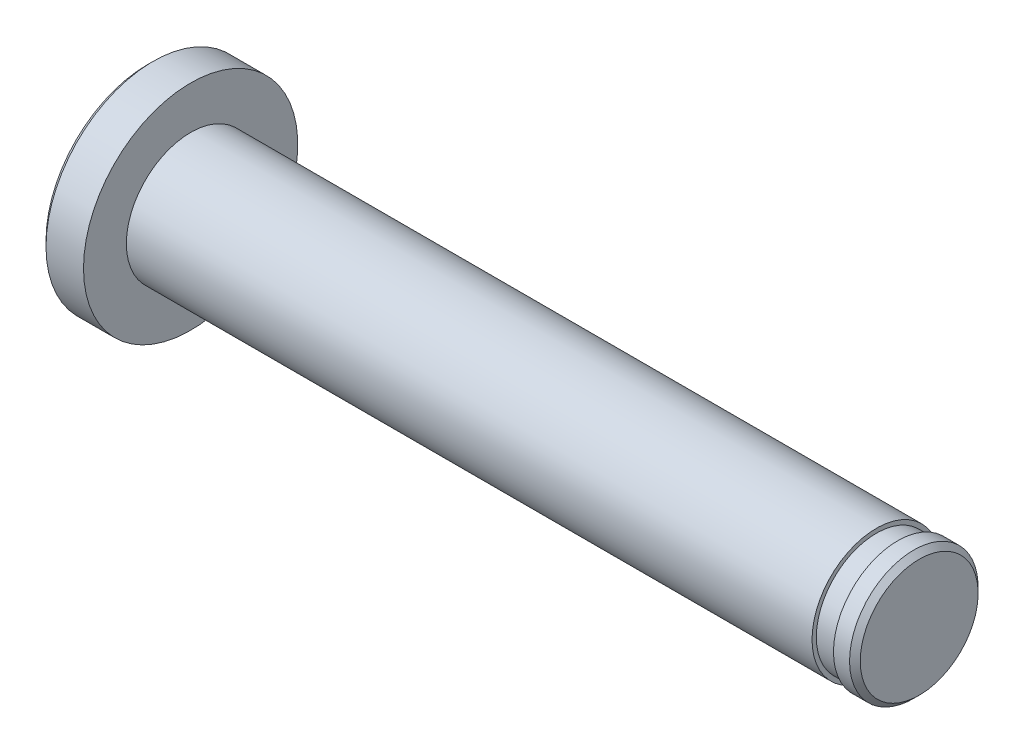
ISO-10303-21;
HEADER;
FILE_DESCRIPTION(('STEP AP214'),'2;1');
FILE_NAME('part.step','',(''),(''),'','','');
FILE_SCHEMA(('AUTOMOTIVE_DESIGN { 1 0 10303 214 1 1 1 1 }'));
ENDSEC;
DATA;
#1=APPLICATION_CONTEXT('core data for automotive mechanical design processes');
#2=APPLICATION_PROTOCOL_DEFINITION('international standard','automotive_design',2000,#1);
#3=PRODUCT_CONTEXT('',#1,'mechanical');
#4=PRODUCT('Part','Part','',(#3));
#5=PRODUCT_RELATED_PRODUCT_CATEGORY('part','',(#4));
#6=PRODUCT_DEFINITION_FORMATION('','',#4);
#7=PRODUCT_DEFINITION_CONTEXT('part definition',#1,'design');
#8=PRODUCT_DEFINITION('design','',#6,#7);
#9=PRODUCT_DEFINITION_SHAPE('','',#8);
#10=(LENGTH_UNIT() NAMED_UNIT(*) SI_UNIT(.MILLI.,.METRE.));
#11=(NAMED_UNIT(*) PLANE_ANGLE_UNIT() SI_UNIT($,.RADIAN.));
#12=(NAMED_UNIT(*) SI_UNIT($,.STERADIAN.) SOLID_ANGLE_UNIT());
#13=UNCERTAINTY_MEASURE_WITH_UNIT(LENGTH_MEASURE(1.E-05),#10,'distance_accuracy_value','');
#14=(GEOMETRIC_REPRESENTATION_CONTEXT(3) GLOBAL_UNCERTAINTY_ASSIGNED_CONTEXT((#13)) GLOBAL_UNIT_ASSIGNED_CONTEXT((#10,
#11,#12)) REPRESENTATION_CONTEXT('',''));
#15=CARTESIAN_POINT('',(0.,0.,0.));
#16=DIRECTION('',(0.,0.,1.));
#17=DIRECTION('',(1.,0.,0.));
#18=AXIS2_PLACEMENT_3D('',#15,#16,#17);
#19=CARTESIAN_POINT('',(34.,2.75,0.));
#20=DIRECTION('',(-1.,0.,0.));
#21=DIRECTION('',(0.,0.,1.));
#22=AXIS2_PLACEMENT_3D('',#19,#20,#21);
#23=PLANE('',#22);
#24=CARTESIAN_POINT('',(34.,0.,0.));
#25=DIRECTION('',(-1.,0.,0.));
#26=DIRECTION('',(0.,0.,1.));
#27=AXIS2_PLACEMENT_3D('',#24,#25,#26);
#28=CIRCLE('',#27,2.75);
#29=CARTESIAN_POINT('',(34.,0.,2.75));
#30=VERTEX_POINT('',#29);
#31=EDGE_CURVE('E10',#30,#30,#28,.T.);
#32=ORIENTED_EDGE('',*,*,#31,.F.);
#33=EDGE_LOOP('',(#32));
#34=FACE_BOUND('',#33,.T.);
#35=ADVANCED_FACE('F31',(#34),#23,.F.);
#36=CARTESIAN_POINT('',(34.,0.,0.));
#37=DIRECTION('',(-1.,0.,0.));
#38=DIRECTION('',(0.,0.,1.));
#39=AXIS2_PLACEMENT_3D('',#36,#37,#38);
#40=CONICAL_SURFACE('',#39,2.75,0.785398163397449);
#41=CARTESIAN_POINT('',(33.75,0.,0.));
#42=DIRECTION('',(-1.,0.,0.));
#43=DIRECTION('',(0.,0.,1.));
#44=AXIS2_PLACEMENT_3D('',#41,#42,#43);
#45=CIRCLE('',#44,3.);
#46=CARTESIAN_POINT('',(33.75,0.,3.));
#47=VERTEX_POINT('',#46);
#48=EDGE_CURVE('E37',#47,#47,#45,.T.);
#49=ORIENTED_EDGE('',*,*,#48,.F.);
#50=EDGE_LOOP('',(#49));
#51=FACE_BOUND('',#50,.T.);
#52=ORIENTED_EDGE('',*,*,#31,.T.);
#53=EDGE_LOOP('',(#52));
#54=FACE_BOUND('',#53,.T.);
#55=ADVANCED_FACE('F115',(#51,#54),#40,.T.);
#56=CARTESIAN_POINT('',(0.,0.,0.));
#57=DIRECTION('',(-1.,0.,0.));
#58=DIRECTION('',(0.,0.,1.));
#59=AXIS2_PLACEMENT_3D('',#56,#57,#58);
#60=CYLINDRICAL_SURFACE('',#59,3.);
#61=CARTESIAN_POINT('',(33.,0.,0.));
#62=DIRECTION('',(-1.,0.,0.));
#63=DIRECTION('',(0.,0.,1.));
#64=AXIS2_PLACEMENT_3D('',#61,#62,#63);
#65=CIRCLE('',#64,3.);
#66=CARTESIAN_POINT('',(33.,0.,3.));
#67=VERTEX_POINT('',#66);
#68=EDGE_CURVE('E41',#67,#67,#65,.T.);
#69=ORIENTED_EDGE('',*,*,#68,.F.);
#70=EDGE_LOOP('',(#69));
#71=FACE_BOUND('',#70,.T.);
#72=ORIENTED_EDGE('',*,*,#48,.T.);
#73=EDGE_LOOP('',(#72));
#74=FACE_BOUND('',#73,.T.);
#75=ADVANCED_FACE('F110',(#71,#74),#60,.T.);
#76=CARTESIAN_POINT('',(33.,2.8,0.));
#77=DIRECTION('',(1.,0.,0.));
#78=DIRECTION('',(0.,0.,-1.));
#79=AXIS2_PLACEMENT_3D('',#76,#77,#78);
#80=PLANE('',#79);
#81=CARTESIAN_POINT('',(33.,0.,0.));
#82=DIRECTION('',(-1.,0.,0.));
#83=DIRECTION('',(0.,0.,1.));
#84=AXIS2_PLACEMENT_3D('',#81,#82,#83);
#85=CIRCLE('',#84,2.8);
#86=CARTESIAN_POINT('',(33.,0.,2.8));
#87=VERTEX_POINT('',#86);
#88=EDGE_CURVE('E45',#87,#87,#85,.T.);
#89=ORIENTED_EDGE('',*,*,#88,.F.);
#90=EDGE_LOOP('',(#89));
#91=FACE_BOUND('',#90,.T.);
#92=ORIENTED_EDGE('',*,*,#68,.T.);
#93=EDGE_LOOP('',(#92));
#94=FACE_BOUND('',#93,.T.);
#95=ADVANCED_FACE('F104',(#91,#94),#80,.F.);
#96=CARTESIAN_POINT('',(0.,0.,0.));
#97=DIRECTION('',(-1.,0.,0.));
#98=DIRECTION('',(0.,0.,1.));
#99=AXIS2_PLACEMENT_3D('',#96,#97,#98);
#100=CYLINDRICAL_SURFACE('',#99,2.8);
#101=CARTESIAN_POINT('',(32.,0.,0.));
#102=DIRECTION('',(-1.,0.,0.));
#103=DIRECTION('',(0.,0.,1.));
#104=AXIS2_PLACEMENT_3D('',#101,#102,#103);
#105=CIRCLE('',#104,2.8);
#106=CARTESIAN_POINT('',(32.,0.,2.8));
#107=VERTEX_POINT('',#106);
#108=EDGE_CURVE('E50',#107,#107,#105,.T.);
#109=ORIENTED_EDGE('',*,*,#108,.F.);
#110=EDGE_LOOP('',(#109));
#111=FACE_BOUND('',#110,.T.);
#112=ORIENTED_EDGE('',*,*,#88,.T.);
#113=EDGE_LOOP('',(#112));
#114=FACE_BOUND('',#113,.T.);
#115=ADVANCED_FACE('F98',(#111,#114),#100,.T.);
#116=CARTESIAN_POINT('',(32.,3.,0.));
#117=DIRECTION('',(-1.,0.,0.));
#118=DIRECTION('',(0.,0.,1.));
#119=AXIS2_PLACEMENT_3D('',#116,#117,#118);
#120=PLANE('',#119);
#121=CARTESIAN_POINT('',(32.,0.,0.));
#122=DIRECTION('',(-1.,0.,0.));
#123=DIRECTION('',(0.,0.,1.));
#124=AXIS2_PLACEMENT_3D('',#121,#122,#123);
#125=CIRCLE('',#124,3.);
#126=CARTESIAN_POINT('',(32.,0.,3.));
#127=VERTEX_POINT('',#126);
#128=EDGE_CURVE('E53',#127,#127,#125,.T.);
#129=ORIENTED_EDGE('',*,*,#128,.F.);
#130=EDGE_LOOP('',(#129));
#131=FACE_BOUND('',#130,.T.);
#132=ORIENTED_EDGE('',*,*,#108,.T.);
#133=EDGE_LOOP('',(#132));
#134=FACE_BOUND('',#133,.T.);
#135=ADVANCED_FACE('F92',(#131,#134),#120,.F.);
#136=CARTESIAN_POINT('',(0.,0.,0.));
#137=DIRECTION('',(-1.,0.,0.));
#138=DIRECTION('',(0.,0.,1.));
#139=AXIS2_PLACEMENT_3D('',#136,#137,#138);
#140=CYLINDRICAL_SURFACE('',#139,3.);
#141=CARTESIAN_POINT('',(0.,0.,0.));
#142=DIRECTION('',(-1.,0.,0.));
#143=DIRECTION('',(0.,0.,1.));
#144=AXIS2_PLACEMENT_3D('',#141,#142,#143);
#145=CIRCLE('',#144,3.);
#146=CARTESIAN_POINT('',(0.,0.,3.));
#147=VERTEX_POINT('',#146);
#148=EDGE_CURVE('E56',#147,#147,#145,.T.);
#149=ORIENTED_EDGE('',*,*,#148,.F.);
#150=EDGE_LOOP('',(#149));
#151=FACE_BOUND('',#150,.T.);
#152=ORIENTED_EDGE('',*,*,#128,.T.);
#153=EDGE_LOOP('',(#152));
#154=FACE_BOUND('',#153,.T.);
#155=ADVANCED_FACE('F86',(#151,#154),#140,.T.);
#156=CARTESIAN_POINT('',(0.,5.,0.));
#157=DIRECTION('',(-1.,0.,0.));
#158=DIRECTION('',(0.,0.,1.));
#159=AXIS2_PLACEMENT_3D('',#156,#157,#158);
#160=PLANE('',#159);
#161=CARTESIAN_POINT('',(0.,0.,0.));
#162=DIRECTION('',(-1.,0.,0.));
#163=DIRECTION('',(0.,0.,1.));
#164=AXIS2_PLACEMENT_3D('',#161,#162,#163);
#165=CIRCLE('',#164,5.);
#166=CARTESIAN_POINT('',(0.,0.,5.));
#167=VERTEX_POINT('',#166);
#168=EDGE_CURVE('E59',#167,#167,#165,.T.);
#169=ORIENTED_EDGE('',*,*,#168,.F.);
#170=EDGE_LOOP('',(#169));
#171=FACE_BOUND('',#170,.T.);
#172=ORIENTED_EDGE('',*,*,#148,.T.);
#173=EDGE_LOOP('',(#172));
#174=FACE_BOUND('',#173,.T.);
#175=ADVANCED_FACE('F80',(#171,#174),#160,.F.);
#176=CARTESIAN_POINT('',(0.,0.,0.));
#177=DIRECTION('',(-1.,0.,0.));
#178=DIRECTION('',(0.,0.,1.));
#179=AXIS2_PLACEMENT_3D('',#176,#177,#178);
#180=CYLINDRICAL_SURFACE('',#179,5.);
#181=CARTESIAN_POINT('',(-1.75,0.,0.));
#182=DIRECTION('',(-1.,0.,0.));
#183=DIRECTION('',(0.,0.,1.));
#184=AXIS2_PLACEMENT_3D('',#181,#182,#183);
#185=CIRCLE('',#184,5.);
#186=CARTESIAN_POINT('',(-1.75,0.,5.));
#187=VERTEX_POINT('',#186);
#188=EDGE_CURVE('E62',#187,#187,#185,.T.);
#189=ORIENTED_EDGE('',*,*,#188,.F.);
#190=EDGE_LOOP('',(#189));
#191=FACE_BOUND('',#190,.T.);
#192=ORIENTED_EDGE('',*,*,#168,.T.);
#193=EDGE_LOOP('',(#192));
#194=FACE_BOUND('',#193,.T.);
#195=ADVANCED_FACE('F74',(#191,#194),#180,.T.);
#196=CARTESIAN_POINT('',(-1.75,0.,0.));
#197=DIRECTION('',(1.,0.,0.));
#198=DIRECTION('',(0.,0.,-1.));
#199=AXIS2_PLACEMENT_3D('',#196,#197,#198);
#200=CONICAL_SURFACE('',#199,5.,0.785398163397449);
#201=CARTESIAN_POINT('',(-2.,0.,0.));
#202=DIRECTION('',(-1.,0.,0.));
#203=DIRECTION('',(0.,0.,1.));
#204=AXIS2_PLACEMENT_3D('',#201,#202,#203);
#205=CIRCLE('',#204,4.75);
#206=CARTESIAN_POINT('',(-2.,0.,4.75));
#207=VERTEX_POINT('',#206);
#208=EDGE_CURVE('E65',#207,#207,#205,.T.);
#209=ORIENTED_EDGE('',*,*,#208,.F.);
#210=EDGE_LOOP('',(#209));
#211=FACE_BOUND('',#210,.T.);
#212=ORIENTED_EDGE('',*,*,#188,.T.);
#213=EDGE_LOOP('',(#212));
#214=FACE_BOUND('',#213,.T.);
#215=ADVANCED_FACE('F71',(#211,#214),#200,.T.);
#216=CARTESIAN_POINT('',(-2.,0.,0.));
#217=DIRECTION('',(1.,0.,0.));
#218=DIRECTION('',(0.,0.,-1.));
#219=AXIS2_PLACEMENT_3D('',#216,#217,#218);
#220=PLANE('',#219);
#221=ORIENTED_EDGE('',*,*,#208,.T.);
#222=EDGE_LOOP('',(#221));
#223=FACE_BOUND('',#222,.T.);
#224=ADVANCED_FACE('F69',(#223),#220,.F.);
#225=CLOSED_SHELL('',(#35,#55,#75,#95,#115,#135,#155,#175,#195,#215,#224));
#226=MANIFOLD_SOLID_BREP('B2',#225);
#227=ADVANCED_BREP_SHAPE_REPRESENTATION('',(#18,#226),#14);
#228=SHAPE_DEFINITION_REPRESENTATION(#9,#227);
ENDSEC;
END-ISO-10303-21;
